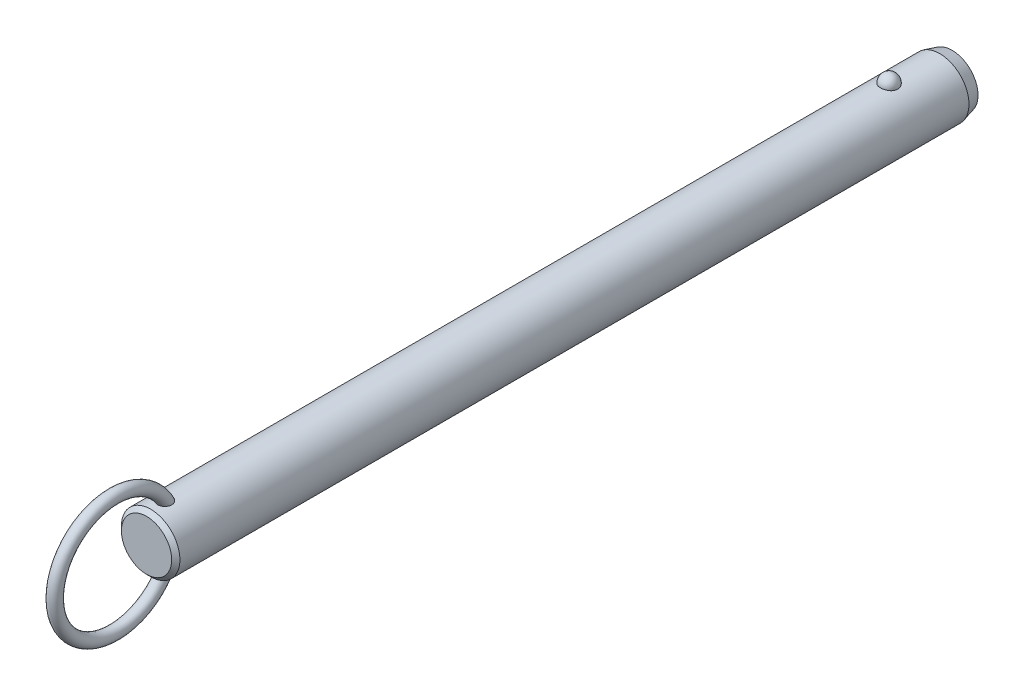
ISO-10303-21;
HEADER;
FILE_DESCRIPTION(('STEP AP214'),'2;1');
FILE_NAME('part.step','',(''),(''),'','','');
FILE_SCHEMA(('AUTOMOTIVE_DESIGN { 1 0 10303 214 1 1 1 1 }'));
ENDSEC;
DATA;
#1=APPLICATION_CONTEXT('core data for automotive mechanical design processes');
#2=APPLICATION_PROTOCOL_DEFINITION('international standard','automotive_design',2000,#1);
#3=PRODUCT_CONTEXT('',#1,'mechanical');
#4=PRODUCT('Part','Part','',(#3));
#5=PRODUCT_RELATED_PRODUCT_CATEGORY('part','',(#4));
#6=PRODUCT_DEFINITION_FORMATION('','',#4);
#7=PRODUCT_DEFINITION_CONTEXT('part definition',#1,'design');
#8=PRODUCT_DEFINITION('design','',#6,#7);
#9=PRODUCT_DEFINITION_SHAPE('','',#8);
#10=(LENGTH_UNIT() NAMED_UNIT(*) SI_UNIT(.MILLI.,.METRE.));
#11=(NAMED_UNIT(*) PLANE_ANGLE_UNIT() SI_UNIT($,.RADIAN.));
#12=(NAMED_UNIT(*) SI_UNIT($,.STERADIAN.) SOLID_ANGLE_UNIT());
#13=UNCERTAINTY_MEASURE_WITH_UNIT(LENGTH_MEASURE(1.E-05),#10,'distance_accuracy_value','');
#14=(GEOMETRIC_REPRESENTATION_CONTEXT(3) GLOBAL_UNCERTAINTY_ASSIGNED_CONTEXT((#13)) GLOBAL_UNIT_ASSIGNED_CONTEXT((#10,
#11,#12)) REPRESENTATION_CONTEXT('',''));
#15=CARTESIAN_POINT('',(0.,0.,0.));
#16=DIRECTION('',(0.,0.,1.));
#17=DIRECTION('',(1.,0.,0.));
#18=AXIS2_PLACEMENT_3D('',#15,#16,#17);
#19=CARTESIAN_POINT('',(0.,0.,170.2));
#20=DIRECTION('',(0.,0.,-1.));
#21=DIRECTION('',(-1.,0.,0.));
#22=AXIS2_PLACEMENT_3D('',#19,#20,#21);
#23=CYLINDRICAL_SURFACE('',#22,7.1);
#24=CARTESIAN_POINT('',(2.0769088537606,6.78943661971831,-2.1));
#25=CARTESIAN_POINT('',(2.07690739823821,6.78943796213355,-1.98268154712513));
#26=CARTESIAN_POINT('',(2.06738130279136,6.79237331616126,-1.86534506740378));
#27=CARTESIAN_POINT('',(2.0295040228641,6.8037853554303,-1.63400788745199));
#28=CARTESIAN_POINT('',(2.00114757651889,6.81226358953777,-1.52000812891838));
#29=CARTESIAN_POINT('',(1.92632025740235,6.83379798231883,-1.29863433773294));
#30=CARTESIAN_POINT('',(1.87985726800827,6.84685214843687,-1.19125744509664));
#31=CARTESIAN_POINT('',(1.76995205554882,6.87608091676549,-0.98604657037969));
#32=CARTESIAN_POINT('',(1.70650980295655,6.8922555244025,-0.88821260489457));
#33=CARTESIAN_POINT('',(1.5638119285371,6.92602930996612,-0.704242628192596));
#34=CARTESIAN_POINT('',(1.4844714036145,6.94363582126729,-0.618173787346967));
#35=CARTESIAN_POINT('',(1.31221746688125,6.97823658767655,-0.460740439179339));
#36=CARTESIAN_POINT('',(1.21930409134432,6.99523084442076,-0.389375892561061));
#37=CARTESIAN_POINT('',(1.02268781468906,7.02666176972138,-0.263547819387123));
#38=CARTESIAN_POINT('',(0.91902009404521,7.04110638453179,-0.209031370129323));
#39=CARTESIAN_POINT('',(0.703548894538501,7.06588726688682,-0.118163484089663));
#40=CARTESIAN_POINT('',(0.591746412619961,7.07622403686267,-0.0818098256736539));
#41=CARTESIAN_POINT('',(0.365557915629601,7.09147068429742,-0.0288711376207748));
#42=CARTESIAN_POINT('',(0.251267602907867,7.09648447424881,-0.0119070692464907));
#43=CARTESIAN_POINT('',(0.0213499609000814,7.10089837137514,0.00304925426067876));
#44=CARTESIAN_POINT('',(-0.0942772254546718,7.10029907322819,0.00104351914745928));
#45=CARTESIAN_POINT('',(-0.321651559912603,7.09360829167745,-0.0216931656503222));
#46=CARTESIAN_POINT('',(-0.433431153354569,7.08760388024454,-0.0421272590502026));
#47=CARTESIAN_POINT('',(-0.651862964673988,7.07086131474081,-0.100729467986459));
#48=CARTESIAN_POINT('',(-0.758515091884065,7.06012307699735,-0.138897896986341));
#49=CARTESIAN_POINT('',(-0.964449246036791,7.03496097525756,-0.232213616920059));
#50=CARTESIAN_POINT('',(-1.06368095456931,7.02051445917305,-0.287465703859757));
#51=CARTESIAN_POINT('',(-1.25145353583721,6.98948740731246,-0.413383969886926));
#52=CARTESIAN_POINT('',(-1.33999321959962,6.97290663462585,-0.48405186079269));
#53=CARTESIAN_POINT('',(-1.50591604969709,6.93898770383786,-0.640594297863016));
#54=CARTESIAN_POINT('',(-1.58302488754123,6.92164094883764,-0.726757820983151));
#55=CARTESIAN_POINT('',(-1.72189320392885,6.8884103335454,-0.91092752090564));
#56=CARTESIAN_POINT('',(-1.78365144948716,6.87252659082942,-1.008934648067));
#57=CARTESIAN_POINT('',(-1.89101272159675,6.84377189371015,-1.21549497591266));
#58=CARTESIAN_POINT('',(-1.93639553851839,6.83094274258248,-1.32416860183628));
#59=CARTESIAN_POINT('',(-2.00874275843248,6.81002070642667,-1.54791500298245));
#60=CARTESIAN_POINT('',(-2.03570774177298,6.80192767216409,-1.66298757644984));
#61=CARTESIAN_POINT('',(-2.07047276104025,6.7914266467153,-1.89571453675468));
#62=CARTESIAN_POINT('',(-2.07835878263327,6.78899315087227,-2.01335491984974));
#63=CARTESIAN_POINT('',(-2.07502083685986,6.79001409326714,-2.24833570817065));
#64=CARTESIAN_POINT('',(-2.06379746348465,6.7934683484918,-2.36567612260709));
#65=CARTESIAN_POINT('',(-2.02263913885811,6.80583442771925,-2.59603194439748));
#66=CARTESIAN_POINT('',(-1.99281127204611,6.81471501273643,-2.70906820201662));
#67=CARTESIAN_POINT('',(-1.91526639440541,6.83691232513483,-2.92836575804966));
#68=CARTESIAN_POINT('',(-1.8675486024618,6.85022924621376,-3.03462676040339));
#69=CARTESIAN_POINT('',(-1.75504492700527,6.87991336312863,-3.23806487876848));
#70=CARTESIAN_POINT('',(-1.69015924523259,6.89629822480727,-3.33518422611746));
#71=CARTESIAN_POINT('',(-1.54505404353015,6.93024852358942,-3.51697105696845));
#72=CARTESIAN_POINT('',(-1.46483385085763,6.94781401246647,-3.60163799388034));
#73=CARTESIAN_POINT('',(-1.29071406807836,6.98225977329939,-3.75654119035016));
#74=CARTESIAN_POINT('',(-1.19675650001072,6.99913673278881,-3.82671308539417));
#75=CARTESIAN_POINT('',(-0.997940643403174,7.03023618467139,-3.9501837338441));
#76=CARTESIAN_POINT('',(-0.89308318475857,7.04445887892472,-4.00348377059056));
#77=CARTESIAN_POINT('',(-0.676902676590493,7.06848365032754,-4.09107242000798));
#78=CARTESIAN_POINT('',(-0.565686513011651,7.0783430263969,-4.12560889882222));
#79=CARTESIAN_POINT('',(-0.338739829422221,7.09282534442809,-4.17575450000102));
#80=CARTESIAN_POINT('',(-0.223009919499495,7.09744899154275,-4.19136617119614));
#81=CARTESIAN_POINT('',(0.00707628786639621,7.10090930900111,-4.20307965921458));
#82=CARTESIAN_POINT('',(0.121410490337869,7.09986531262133,-4.19958377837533));
#83=CARTESIAN_POINT('',(0.347815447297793,7.092380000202,-4.17411564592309));
#84=CARTESIAN_POINT('',(0.459886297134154,7.08593891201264,-4.15214417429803));
#85=CARTESIAN_POINT('',(0.678084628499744,7.06838983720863,-4.09049562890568));
#86=CARTESIAN_POINT('',(0.784237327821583,7.05730369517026,-4.05090137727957));
#87=CARTESIAN_POINT('',(0.988305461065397,7.03163139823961,-3.95511447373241));
#88=CARTESIAN_POINT('',(1.08622031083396,7.01704499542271,-3.89892064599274));
#89=CARTESIAN_POINT('',(1.27284490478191,6.98562668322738,-3.77035541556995));
#90=CARTESIAN_POINT('',(1.36137372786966,6.96876135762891,-3.69772964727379));
#91=CARTESIAN_POINT('',(1.52509486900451,6.93477412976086,-3.53878279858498));
#92=CARTESIAN_POINT('',(1.60028496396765,6.91765218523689,-3.45245943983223));
#93=CARTESIAN_POINT('',(1.73681688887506,6.88465753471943,-3.26658774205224));
#94=CARTESIAN_POINT('',(1.79785966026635,6.86881574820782,-3.16681408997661));
#95=CARTESIAN_POINT('',(1.90265327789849,6.84053157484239,-2.95814408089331));
#96=CARTESIAN_POINT('',(1.94640861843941,6.82808830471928,-2.84925010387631));
#97=CARTESIAN_POINT('',(2.01274378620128,6.80881460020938,-2.63454318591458));
#98=CARTESIAN_POINT('',(2.03676193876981,6.80160856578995,-2.52920574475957));
#99=CARTESIAN_POINT('',(2.06884490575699,6.79191902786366,-2.3159172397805));
#100=CARTESIAN_POINT('',(2.07691019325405,6.78943538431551,-2.20796625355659));
#101=CARTESIAN_POINT('',(2.0769088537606,6.78943661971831,-2.1));
#102=B_SPLINE_CURVE_WITH_KNOTS('',3,(#24,#25,#26,#27,#28,#29,#30,#31,#32,#33,#34,#35,#36,#37,
#38,#39,#40,#41,#42,#43,#44,#45,#46,#47,#48,#49,#50,#51,#52,#53,#54,#55,#56,#57,#58,#59,#60,#61,
#62,#63,#64,#65,#66,#67,#68,#69,#70,#71,#72,#73,#74,#75,#76,#77,#78,#79,#80,#81,#82,#83,#84,#85,
#86,#87,#88,#89,#90,#91,#92,#93,#94,#95,#96,#97,#98,#99,#100,#101),.UNSPECIFIED.,.T.,.F.,(4,2,2,
2,2,2,2,2,2,2,2,2,2,2,2,2,2,2,2,2,2,2,2,2,2,2,2,2,2,2,2,2,2,2,2,2,2,2,4),(0.,0.351568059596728,
0.703234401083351,1.05474780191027,1.40626181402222,1.75970563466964,2.11314851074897,
2.4654696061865,2.81774759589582,3.16301449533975,3.50824481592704,3.84801136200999,
4.18778391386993,4.52968352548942,4.87162112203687,5.22076181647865,5.56993054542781,
5.92363364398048,6.27732559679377,6.62942052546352,6.98150450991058,7.33158042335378,
7.68167162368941,8.03384443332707,8.38603269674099,8.73975272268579,9.09344583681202,
9.44234545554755,9.79119807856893,10.1327344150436,10.4742563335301,10.8141898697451,
11.1541474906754,11.4997793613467,11.8454687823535,12.1979079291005,12.5502553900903,
12.8738073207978,13.1973496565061),.UNSPECIFIED.);
#103=CARTESIAN_POINT('',(2.0769088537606,6.78943661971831,-2.1));
#104=VERTEX_POINT('',#103);
#105=EDGE_CURVE('E41',#104,#104,#102,.T.);
#106=ORIENTED_EDGE('',*,*,#105,.T.);
#107=EDGE_LOOP('',(#106));
#108=FACE_BOUND('',#107,.T.);
#109=CARTESIAN_POINT('',(0.,0.,177.12));
#110=DIRECTION('',(0.,0.,1.));
#111=DIRECTION('',(1.,0.,0.));
#112=AXIS2_PLACEMENT_3D('',#109,#110,#111);
#113=CIRCLE('',#112,7.1);
#114=CARTESIAN_POINT('',(7.1,0.,177.12));
#115=VERTEX_POINT('',#114);
#116=EDGE_CURVE('E10',#115,#115,#113,.F.);
#117=ORIENTED_EDGE('',*,*,#116,.T.);
#118=EDGE_LOOP('',(#117));
#119=FACE_BOUND('',#118,.T.);
#120=CARTESIAN_POINT('',(-0.429539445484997,-7.08699541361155,171.942921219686));
#121=CARTESIAN_POINT('',(-0.508331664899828,-7.08221999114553,171.966876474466));
#122=CARTESIAN_POINT('',(-0.585039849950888,-7.07624016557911,171.997457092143));
#123=CARTESIAN_POINT('',(-0.73208265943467,-7.06254296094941,172.071024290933));
#124=CARTESIAN_POINT('',(-0.802417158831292,-7.05482554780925,172.114011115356));
#125=CARTESIAN_POINT('',(-0.934722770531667,-7.03851844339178,172.211113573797));
#126=CARTESIAN_POINT('',(-0.996700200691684,-7.02992941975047,172.265220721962));
#127=CARTESIAN_POINT('',(-1.11079942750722,-7.01280697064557,172.382967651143));
#128=CARTESIAN_POINT('',(-1.16292136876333,-7.00427354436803,172.446607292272));
#129=CARTESIAN_POINT('',(-1.25705660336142,-6.98799959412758,172.582687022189));
#130=CARTESIAN_POINT('',(-1.29888032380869,-6.98027525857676,172.655259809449));
#131=CARTESIAN_POINT('',(-1.37069920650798,-6.96652886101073,172.806168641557));
#132=CARTESIAN_POINT('',(-1.40069157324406,-6.96050720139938,172.884506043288));
#133=CARTESIAN_POINT('',(-1.45043507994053,-6.95031881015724,173.050190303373));
#134=CARTESIAN_POINT('',(-1.46937115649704,-6.94630231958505,173.137789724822));
#135=CARTESIAN_POINT('',(-1.49424917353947,-6.94099239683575,173.314871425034));
#136=CARTESIAN_POINT('',(-1.50018601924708,-6.93970003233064,173.404354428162));
#137=CARTESIAN_POINT('',(-1.49978214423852,-6.93978815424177,173.594060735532));
#138=CARTESIAN_POINT('',(-1.49187639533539,-6.94150934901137,173.694279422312));
#139=CARTESIAN_POINT('',(-1.46177925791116,-6.94790814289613,173.892479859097));
#140=CARTESIAN_POINT('',(-1.43957541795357,-6.95258831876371,173.990459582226));
#141=CARTESIAN_POINT('',(-1.37783293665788,-6.96510647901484,174.19536292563));
#142=CARTESIAN_POINT('',(-1.33634073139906,-6.97328848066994,174.301680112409));
#143=CARTESIAN_POINT('',(-1.23686994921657,-6.99161706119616,174.506177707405));
#144=CARTESIAN_POINT('',(-1.17889192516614,-7.00176357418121,174.604358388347));
#145=CARTESIAN_POINT('',(-1.0587512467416,-7.02082898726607,174.772374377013));
#146=CARTESIAN_POINT('',(-0.999247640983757,-7.02963746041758,174.844123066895));
#147=CARTESIAN_POINT('',(-0.869494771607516,-7.04686074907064,174.977195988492));
#148=CARTESIAN_POINT('',(-0.799263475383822,-7.05527619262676,175.038537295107));
#149=CARTESIAN_POINT('',(-0.665408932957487,-7.06899457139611,175.135131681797));
#150=CARTESIAN_POINT('',(-0.603817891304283,-7.07457275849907,175.173151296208));
#151=CARTESIAN_POINT('',(-0.475172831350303,-7.08437420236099,175.238758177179));
#152=CARTESIAN_POINT('',(-0.408123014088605,-7.08859848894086,175.266353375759));
#153=CARTESIAN_POINT('',(-0.269431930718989,-7.09522749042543,175.309256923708));
#154=CARTESIAN_POINT('',(-0.197757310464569,-7.09761688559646,175.324461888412));
#155=CARTESIAN_POINT('',(-0.0527849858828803,-7.10017268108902,175.340716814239));
#156=CARTESIAN_POINT('',(0.0205115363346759,-7.10034065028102,175.341776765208));
#157=CARTESIAN_POINT('',(0.156426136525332,-7.09855986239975,175.330461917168));
#158=CARTESIAN_POINT('',(0.219199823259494,-7.09688191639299,175.319806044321));
#159=CARTESIAN_POINT('',(0.342134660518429,-7.09201880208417,175.288537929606));
#160=CARTESIAN_POINT('',(0.402295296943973,-7.08883333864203,175.267923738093));
#161=CARTESIAN_POINT('',(0.520687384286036,-7.08113868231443,175.217212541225));
#162=CARTESIAN_POINT('',(0.578791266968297,-7.07658958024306,175.186827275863));
#163=CARTESIAN_POINT('',(0.690173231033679,-7.06659708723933,175.118367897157));
#164=CARTESIAN_POINT('',(0.743447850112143,-7.061153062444,175.080288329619));
#165=CARTESIAN_POINT('',(0.870947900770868,-7.04680292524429,174.976592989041));
#166=CARTESIAN_POINT('',(0.941828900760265,-7.03755800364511,174.906897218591));
#167=CARTESIAN_POINT('',(1.07136606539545,-7.01900793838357,174.756945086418));
#168=CARTESIAN_POINT('',(1.13000013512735,-7.00970271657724,174.676670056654));
#169=CARTESIAN_POINT('',(1.23579584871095,-6.99183327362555,174.506899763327));
#170=CARTESIAN_POINT('',(1.28274271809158,-6.98328455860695,174.417269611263));
#171=CARTESIAN_POINT('',(1.36351442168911,-6.96796352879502,174.232176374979));
#172=CARTESIAN_POINT('',(1.39733971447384,-6.96119115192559,174.136713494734));
#173=CARTESIAN_POINT('',(1.45579181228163,-6.94922464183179,173.92530928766));
#174=CARTESIAN_POINT('',(1.47790145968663,-6.94449000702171,173.808631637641));
#175=CARTESIAN_POINT('',(1.50168752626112,-6.93938731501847,173.573015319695));
#176=CARTESIAN_POINT('',(1.50336085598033,-6.93901991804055,173.45407631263));
#177=CARTESIAN_POINT('',(1.48486516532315,-6.9430010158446,173.22360799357));
#178=CARTESIAN_POINT('',(1.46573441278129,-6.9471253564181,173.111995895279));
#179=CARTESIAN_POINT('',(1.40606892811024,-6.95944667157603,172.894886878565));
#180=CARTESIAN_POINT('',(1.36556446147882,-6.96763788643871,172.7893815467));
#181=CARTESIAN_POINT('',(1.2708270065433,-6.98548038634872,172.604287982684));
#182=CARTESIAN_POINT('',(1.21949810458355,-6.99473841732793,172.523171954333));
#183=CARTESIAN_POINT('',(1.10242050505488,-7.01414069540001,172.372227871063));
#184=CARTESIAN_POINT('',(1.03668119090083,-7.02428436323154,172.30239252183));
#185=CARTESIAN_POINT('',(0.900559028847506,-7.04295285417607,172.183573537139));
#186=CARTESIAN_POINT('',(0.831428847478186,-7.05153466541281,172.133157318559));
#187=CARTESIAN_POINT('',(0.685291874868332,-7.06723150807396,172.045142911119));
#188=CARTESIAN_POINT('',(0.608287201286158,-7.07434693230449,172.007541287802));
#189=CARTESIAN_POINT('',(0.451878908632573,-7.08602232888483,171.947491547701));
#190=CARTESIAN_POINT('',(0.372686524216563,-7.09067127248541,171.924508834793));
#191=CARTESIAN_POINT('',(0.211477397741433,-7.09730788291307,171.892035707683));
#192=CARTESIAN_POINT('',(0.129460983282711,-7.09929585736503,171.88254373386));
#193=CARTESIAN_POINT('',(-0.0332905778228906,-7.10037858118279,171.877351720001));
#194=CARTESIAN_POINT('',(-0.114016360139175,-7.09953334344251,171.881365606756));
#195=CARTESIAN_POINT('',(-0.273670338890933,-7.09517338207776,171.902454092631));
#196=CARTESIAN_POINT('',(-0.352598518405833,-7.09165863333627,171.919528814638));
#197=CARTESIAN_POINT('',(-0.429539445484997,-7.08699541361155,171.942921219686));
#198=B_SPLINE_CURVE_WITH_KNOTS('',3,(#120,#121,#122,#123,#124,#125,#126,#127,#128,#129,#130,
#131,#132,#133,#134,#135,#136,#137,#138,#139,#140,#141,#142,#143,#144,#145,#146,#147,#148,#149,
#150,#151,#152,#153,#154,#155,#156,#157,#158,#159,#160,#161,#162,#163,#164,#165,#166,#167,#168,
#169,#170,#171,#172,#173,#174,#175,#176,#177,#178,#179,#180,#181,#182,#183,#184,#185,#186,#187,
#188,#189,#190,#191,#192,#193,#194,#195,#196,#197),.UNSPECIFIED.,.T.,.F.,(4,2,2,2,2,2,2,2,2,2,2,
2,2,2,2,2,2,2,2,2,2,2,2,2,2,2,2,2,2,2,2,2,2,2,2,2,2,2,4),(0.,0.247183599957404,
0.494372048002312,0.741372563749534,0.988369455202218,1.23962059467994,1.490931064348,
1.75897818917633,2.02713035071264,2.32758265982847,2.62829697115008,2.97008736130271,
3.31186629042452,3.59175319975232,3.87117637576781,4.08813841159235,4.30493502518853,
4.5235225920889,4.74195577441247,4.93215328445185,5.12238804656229,5.31884850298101,
5.51544871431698,5.81332317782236,6.11173048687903,6.41527266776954,6.71880423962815,
7.07358156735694,7.42841252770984,7.76631485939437,8.10373999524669,8.39142246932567,
8.67891817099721,8.93560332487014,9.19221962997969,9.43881106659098,9.68537399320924,
9.9267475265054,10.1681233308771),.UNSPECIFIED.);
#199=CARTESIAN_POINT('',(-0.429539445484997,-7.08699541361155,171.942921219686));
#200=VERTEX_POINT('',#199);
#201=EDGE_CURVE('E59',#200,#200,#198,.T.);
#202=ORIENTED_EDGE('',*,*,#201,.T.);
#203=EDGE_LOOP('',(#202));
#204=FACE_BOUND('',#203,.T.);
#205=CARTESIAN_POINT('',(-0.429539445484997,7.08699541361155,171.942921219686));
#206=CARTESIAN_POINT('',(-0.35166550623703,7.09171429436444,171.919246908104));
#207=CARTESIAN_POINT('',(-0.271733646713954,7.09525896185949,171.902036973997));
#208=CARTESIAN_POINT('',(-0.110026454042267,7.09960839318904,171.881005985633));
#209=CARTESIAN_POINT('',(-0.0282502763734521,7.10041187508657,171.877191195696));
#210=CARTESIAN_POINT('',(0.134782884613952,7.09918849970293,171.883059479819));
#211=CARTESIAN_POINT('',(0.216039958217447,7.09716214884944,171.89274013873));
#212=CARTESIAN_POINT('',(0.375730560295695,7.09050177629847,171.925347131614));
#213=CARTESIAN_POINT('',(0.454164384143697,7.08586802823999,171.948272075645));
#214=CARTESIAN_POINT('',(0.606025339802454,7.07449911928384,172.006771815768));
#215=CARTESIAN_POINT('',(0.67945100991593,7.06776334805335,172.042350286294));
#216=CARTESIAN_POINT('',(0.819234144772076,7.05292866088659,172.125175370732));
#217=CARTESIAN_POINT('',(0.88559181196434,7.04482978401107,172.172421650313));
#218=CARTESIAN_POINT('',(1.00993211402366,7.02808709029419,172.277590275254));
#219=CARTESIAN_POINT('',(1.06785399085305,7.01943990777,172.335583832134));
#220=CARTESIAN_POINT('',(1.17342527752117,7.00256662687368,172.460301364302));
#221=CARTESIAN_POINT('',(1.22107408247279,6.99434055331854,172.527025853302));
#222=CARTESIAN_POINT('',(1.30652927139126,6.97889183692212,172.669362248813));
#223=CARTESIAN_POINT('',(1.34399711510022,6.97170674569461,172.745180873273));
#224=CARTESIAN_POINT('',(1.40682616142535,6.95930080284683,172.901810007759));
#225=CARTESIAN_POINT('',(1.43218374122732,6.95408053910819,172.98262200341));
#226=CARTESIAN_POINT('',(1.47246409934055,6.94566853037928,173.153531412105));
#227=CARTESIAN_POINT('',(1.48642590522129,6.9426653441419,173.24386307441));
#228=CARTESIAN_POINT('',(1.5011410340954,6.93949744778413,173.425619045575));
#229=CARTESIAN_POINT('',(1.50188917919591,6.93933385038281,173.517043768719));
#230=CARTESIAN_POINT('',(1.49030464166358,6.94183245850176,173.71084381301));
#231=CARTESIAN_POINT('',(1.47627413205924,6.94486147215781,173.813112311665));
#232=CARTESIAN_POINT('',(1.43356351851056,6.95380194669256,174.014471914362));
#233=CARTESIAN_POINT('',(1.4048676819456,6.95971650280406,174.113559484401));
#234=CARTESIAN_POINT('',(1.32908750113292,6.97461208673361,174.318908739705));
#235=CARTESIAN_POINT('',(1.28011435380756,6.98388945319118,174.424456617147));
#236=CARTESIAN_POINT('',(1.16520357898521,7.00397743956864,174.625760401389));
#237=CARTESIAN_POINT('',(1.09927694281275,7.01478706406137,174.721522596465));
#238=CARTESIAN_POINT('',(0.969361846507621,7.03373936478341,174.876756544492));
#239=CARTESIAN_POINT('',(0.909042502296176,7.04187023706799,174.939303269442));
#240=CARTESIAN_POINT('',(0.779178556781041,7.05741732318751,175.054053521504));
#241=CARTESIAN_POINT('',(0.709649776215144,7.06483472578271,175.106274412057));
#242=CARTESIAN_POINT('',(0.576854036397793,7.0767751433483,175.188113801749));
#243=CARTESIAN_POINT('',(0.515118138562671,7.08158033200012,175.220164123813));
#244=CARTESIAN_POINT('',(0.387127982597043,7.08972701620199,175.273765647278));
#245=CARTESIAN_POINT('',(0.320877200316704,7.09306962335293,175.295324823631));
#246=CARTESIAN_POINT('',(0.185041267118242,7.09791507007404,175.326400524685));
#247=CARTESIAN_POINT('',(0.115437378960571,7.09940591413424,175.335838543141));
#248=CARTESIAN_POINT('',(-0.0243157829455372,7.10030171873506,175.341522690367));
#249=CARTESIAN_POINT('',(-0.0944648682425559,7.0997073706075,175.337773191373));
#250=CARTESIAN_POINT('',(-0.225713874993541,7.09668414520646,175.318508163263));
#251=CARTESIAN_POINT('',(-0.287006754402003,7.09444865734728,175.304232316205));
#252=CARTESIAN_POINT('',(-0.406555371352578,7.08860360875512,175.266368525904));
#253=CARTESIAN_POINT('',(-0.464809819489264,7.08499346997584,175.242776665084));
#254=CARTESIAN_POINT('',(-0.594955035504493,7.07541654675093,175.178923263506));
#255=CARTESIAN_POINT('',(-0.665389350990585,7.06906574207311,175.135753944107));
#256=CARTESIAN_POINT('',(-0.798242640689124,7.05530261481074,175.038587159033));
#257=CARTESIAN_POINT('',(-0.860645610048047,7.0478882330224,174.984568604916));
#258=CARTESIAN_POINT('',(-0.994249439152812,7.03045217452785,174.850996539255));
#259=CARTESIAN_POINT('',(-1.06260129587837,7.02030745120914,174.768614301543));
#260=CARTESIAN_POINT('',(-1.18502045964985,7.00068382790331,174.593843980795));
#261=CARTESIAN_POINT('',(-1.23907684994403,6.99120544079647,174.501448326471));
#262=CARTESIAN_POINT('',(-1.33335589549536,6.97384343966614,174.308008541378));
#263=CARTESIAN_POINT('',(-1.37336138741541,6.96598557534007,174.206856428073));
#264=CARTESIAN_POINT('',(-1.43770677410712,6.9529905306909,173.999504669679));
#265=CARTESIAN_POINT('',(-1.46204473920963,6.94785368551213,173.89330440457));
#266=CARTESIAN_POINT('',(-1.49537533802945,6.94076296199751,173.668231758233));
#267=CARTESIAN_POINT('',(-1.50273564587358,6.93914842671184,173.54909751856));
#268=CARTESIAN_POINT('',(-1.4954555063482,6.94072368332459,173.311470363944));
#269=CARTESIAN_POINT('',(-1.48082914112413,6.94391040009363,173.192977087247));
#270=CARTESIAN_POINT('',(-1.43076401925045,6.95438579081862,172.973432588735));
#271=CARTESIAN_POINT('',(-1.39762227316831,6.96121852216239,172.871841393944));
#272=CARTESIAN_POINT('',(-1.31211274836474,6.97783941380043,172.677351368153));
#273=CARTESIAN_POINT('',(-1.25976607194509,6.98762432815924,172.58444313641));
#274=CARTESIAN_POINT('',(-1.14583073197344,7.00713153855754,172.424160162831));
#275=CARTESIAN_POINT('',(-1.08665947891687,7.01665982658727,172.355035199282));
#276=CARTESIAN_POINT('',(-0.95660664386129,7.03556646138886,172.228878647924));
#277=CARTESIAN_POINT('',(-0.885737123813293,7.04494495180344,172.171834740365));
#278=CARTESIAN_POINT('',(-0.7515580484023,7.06035735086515,172.083100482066));
#279=CARTESIAN_POINT('',(-0.690120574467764,7.0666695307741,172.048593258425));
#280=CARTESIAN_POINT('',(-0.562815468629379,7.07794609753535,171.988750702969));
#281=CARTESIAN_POINT('',(-0.496948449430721,7.08291067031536,171.963414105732));
#282=CARTESIAN_POINT('',(-0.429539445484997,7.08699541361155,171.942921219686));
#283=B_SPLINE_CURVE_WITH_KNOTS('',3,(#205,#206,#207,#208,#209,#210,#211,#212,#213,#214,#215,
#216,#217,#218,#219,#220,#221,#222,#223,#224,#225,#226,#227,#228,#229,#230,#231,#232,#233,#234,
#235,#236,#237,#238,#239,#240,#241,#242,#243,#244,#245,#246,#247,#248,#249,#250,#251,#252,#253,
#254,#255,#256,#257,#258,#259,#260,#261,#262,#263,#264,#265,#266,#267,#268,#269,#270,#271,#272,
#273,#274,#275,#276,#277,#278,#279,#280,#281,#282),.UNSPECIFIED.,.T.,.F.,(4,2,2,2,2,2,2,2,2,2,2,
2,2,2,2,2,2,2,2,2,2,2,2,2,2,2,2,2,2,2,2,2,2,2,2,2,2,2,4),(0.,0.244335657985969,
0.488785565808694,0.733191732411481,0.977572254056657,1.2220237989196,1.46646834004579,
1.71259457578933,1.9587352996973,2.21226768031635,2.46587585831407,2.73913816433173,
3.01250754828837,3.32109936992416,3.63002293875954,3.9786351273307,4.32702187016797,
4.58793945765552,4.84841449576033,5.05676704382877,5.26496096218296,5.47449661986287,
5.68396281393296,5.87205447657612,6.06022532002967,6.30743751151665,6.55513496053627,
6.87602468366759,7.1971587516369,7.52305774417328,7.84899686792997,8.2051615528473,
8.56109821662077,8.88040084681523,9.19935367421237,9.47236282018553,9.74509220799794,
9.95662250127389,10.1681235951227),.UNSPECIFIED.);
#284=CARTESIAN_POINT('',(-0.429539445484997,7.08699541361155,171.942921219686));
#285=VERTEX_POINT('',#284);
#286=EDGE_CURVE('E67',#285,#285,#283,.T.);
#287=ORIENTED_EDGE('',*,*,#286,.T.);
#288=EDGE_LOOP('',(#287));
#289=FACE_BOUND('',#288,.T.);
#290=CARTESIAN_POINT('',(0.,0.,-14.3999999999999));
#291=DIRECTION('',(0.,0.,-1.));
#292=DIRECTION('',(-1.,0.,0.));
#293=AXIS2_PLACEMENT_3D('',#290,#291,#292);
#294=CIRCLE('',#293,7.1);
#295=CARTESIAN_POINT('',(-7.1,0.,-14.3999999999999));
#296=VERTEX_POINT('',#295);
#297=EDGE_CURVE('E56',#296,#296,#294,.F.);
#298=ORIENTED_EDGE('',*,*,#297,.T.);
#299=EDGE_LOOP('',(#298));
#300=FACE_BOUND('',#299,.T.);
#301=ADVANCED_FACE('F37',(#108,#119,#204,#289,#300),#23,.T.);
#302=CARTESIAN_POINT('',(0.,0.,-17.4));
#303=DIRECTION('',(0.,0.,-1.));
#304=DIRECTION('',(-1.,0.,0.));
#305=AXIS2_PLACEMENT_3D('',#302,#303,#304);
#306=PLANE('',#305);
#307=CARTESIAN_POINT('',(0.,0.,-17.4));
#308=DIRECTION('',(0.,0.,-1.));
#309=DIRECTION('',(-1.,0.,0.));
#310=AXIS2_PLACEMENT_3D('',#307,#308,#309);
#311=CIRCLE('',#310,6.29615242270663);
#312=CARTESIAN_POINT('',(-6.29615242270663,0.,-17.4));
#313=VERTEX_POINT('',#312);
#314=EDGE_CURVE('E66',#313,#313,#311,.T.);
#315=ORIENTED_EDGE('',*,*,#314,.T.);
#316=EDGE_LOOP('',(#315));
#317=FACE_BOUND('',#316,.T.);
#318=ADVANCED_FACE('F85',(#317),#306,.T.);
#319=CARTESIAN_POINT('',(0.,0.,-17.4));
#320=DIRECTION('',(0.,0.,1.));
#321=DIRECTION('',(1.,0.,0.));
#322=AXIS2_PLACEMENT_3D('',#319,#320,#321);
#323=CONICAL_SURFACE('',#322,6.29615242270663,0.261799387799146);
#324=ORIENTED_EDGE('',*,*,#297,.F.);
#325=EDGE_LOOP('',(#324));
#326=FACE_BOUND('',#325,.T.);
#327=ORIENTED_EDGE('',*,*,#314,.F.);
#328=EDGE_LOOP('',(#327));
#329=FACE_BOUND('',#328,.T.);
#330=ADVANCED_FACE('F83',(#326,#329),#323,.T.);
#331=CARTESIAN_POINT('',(0.,0.,178.12));
#332=DIRECTION('',(0.,0.,1.));
#333=DIRECTION('',(1.,0.,0.));
#334=AXIS2_PLACEMENT_3D('',#331,#332,#333);
#335=PLANE('',#334);
#336=CARTESIAN_POINT('',(0.,0.,178.12));
#337=DIRECTION('',(0.,0.,1.));
#338=DIRECTION('',(1.,0.,0.));
#339=AXIS2_PLACEMENT_3D('',#336,#337,#338);
#340=CIRCLE('',#339,6.10000000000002);
#341=CARTESIAN_POINT('',(6.10000000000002,0.,178.12));
#342=VERTEX_POINT('',#341);
#343=EDGE_CURVE('E50',#342,#342,#340,.T.);
#344=ORIENTED_EDGE('',*,*,#343,.T.);
#345=EDGE_LOOP('',(#344));
#346=FACE_BOUND('',#345,.T.);
#347=ADVANCED_FACE('F77',(#346),#335,.T.);
#348=CARTESIAN_POINT('',(0.,0.,186.05));
#349=DIRECTION('',(1.,0.,0.));
#350=DIRECTION('',(0.,0.,-1.));
#351=AXIS2_PLACEMENT_3D('',#348,#349,#350);
#352=TOROIDAL_SURFACE('',#351,14.35,1.5);
#353=ORIENTED_EDGE('',*,*,#286,.F.);
#354=EDGE_LOOP('',(#353));
#355=FACE_BOUND('',#354,.T.);
#356=ORIENTED_EDGE('',*,*,#201,.F.);
#357=EDGE_LOOP('',(#356));
#358=FACE_BOUND('',#357,.T.);
#359=ADVANCED_FACE('F73',(#355,#358),#352,.T.);
#360=CARTESIAN_POINT('',(0.,0.,178.12));
#361=DIRECTION('',(0.,0.,-1.));
#362=DIRECTION('',(-1.,0.,0.));
#363=AXIS2_PLACEMENT_3D('',#360,#361,#362);
#364=CONICAL_SURFACE('',#363,6.10000000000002,0.78539816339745);
#365=ORIENTED_EDGE('',*,*,#116,.F.);
#366=EDGE_LOOP('',(#365));
#367=FACE_BOUND('',#366,.T.);
#368=ORIENTED_EDGE('',*,*,#343,.F.);
#369=EDGE_LOOP('',(#368));
#370=FACE_BOUND('',#369,.T.);
#371=ADVANCED_FACE('F39',(#367,#370),#364,.T.);
#372=CARTESIAN_POINT('',(0.,7.1,-2.1));
#373=DIRECTION('',(0.,1.,0.));
#374=DIRECTION('',(0.,0.,1.));
#375=AXIS2_PLACEMENT_3D('',#372,#373,#374);
#376=SPHERICAL_SURFACE('',#375,2.10000000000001);
#377=ORIENTED_EDGE('',*,*,#105,.F.);
#378=EDGE_LOOP('',(#377));
#379=FACE_BOUND('',#378,.T.);
#380=ADVANCED_FACE('F79',(#379),#376,.T.);
#381=CLOSED_SHELL('',(#301,#318,#330,#347,#359,#371,#380));
#382=MANIFOLD_SOLID_BREP('B2',#381);
#383=ADVANCED_BREP_SHAPE_REPRESENTATION('',(#18,#382),#14);
#384=SHAPE_DEFINITION_REPRESENTATION(#9,#383);
ENDSEC;
END-ISO-10303-21;
